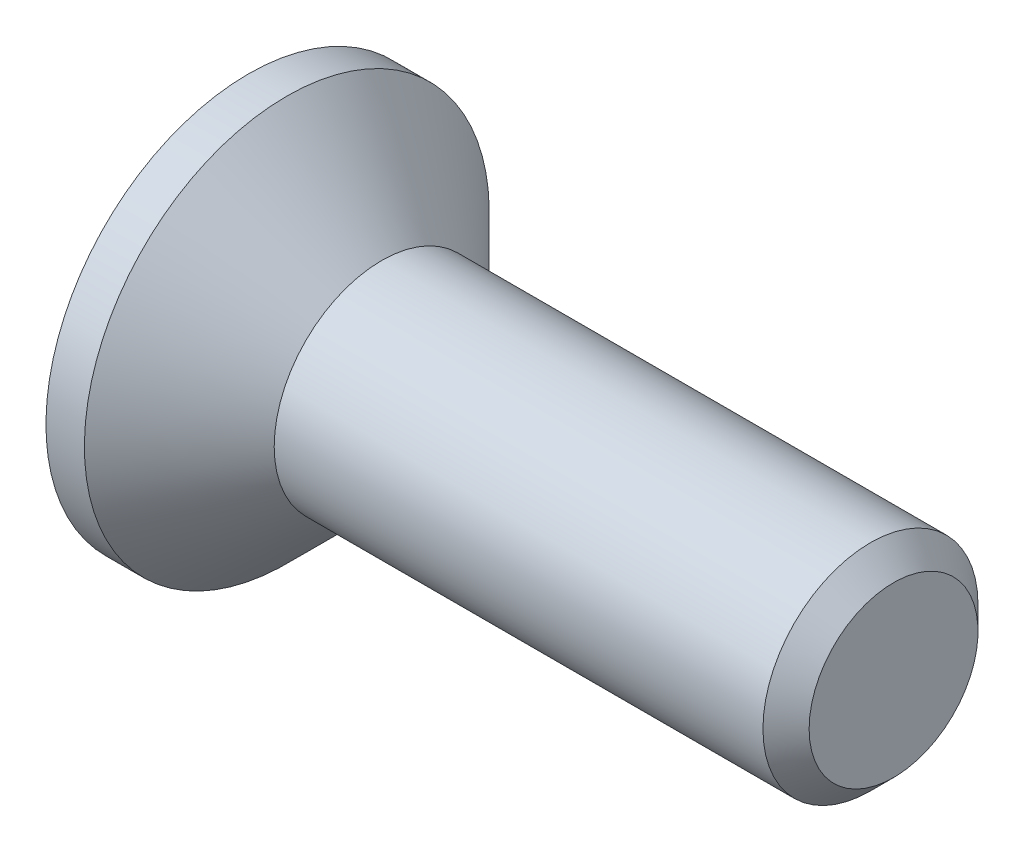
ISO-10303-21;
HEADER;
FILE_DESCRIPTION(('STEP AP214'),'2;1');
FILE_NAME('part.step','',(''),(''),'','','');
FILE_SCHEMA(('AUTOMOTIVE_DESIGN { 1 0 10303 214 1 1 1 1 }'));
ENDSEC;
DATA;
#1=APPLICATION_CONTEXT('core data for automotive mechanical design processes');
#2=APPLICATION_PROTOCOL_DEFINITION('international standard','automotive_design',2000,#1);
#3=PRODUCT_CONTEXT('',#1,'mechanical');
#4=PRODUCT('Part','Part','',(#3));
#5=PRODUCT_RELATED_PRODUCT_CATEGORY('part','',(#4));
#6=PRODUCT_DEFINITION_FORMATION('','',#4);
#7=PRODUCT_DEFINITION_CONTEXT('part definition',#1,'design');
#8=PRODUCT_DEFINITION('design','',#6,#7);
#9=PRODUCT_DEFINITION_SHAPE('','',#8);
#10=(LENGTH_UNIT() NAMED_UNIT(*) SI_UNIT(.MILLI.,.METRE.));
#11=(NAMED_UNIT(*) PLANE_ANGLE_UNIT() SI_UNIT($,.RADIAN.));
#12=(NAMED_UNIT(*) SI_UNIT($,.STERADIAN.) SOLID_ANGLE_UNIT());
#13=UNCERTAINTY_MEASURE_WITH_UNIT(LENGTH_MEASURE(1.E-05),#10,'distance_accuracy_value','');
#14=(GEOMETRIC_REPRESENTATION_CONTEXT(3) GLOBAL_UNCERTAINTY_ASSIGNED_CONTEXT((#13)) GLOBAL_UNIT_ASSIGNED_CONTEXT((#10,
#11,#12)) REPRESENTATION_CONTEXT('',''));
#15=CARTESIAN_POINT('',(0.,0.,0.));
#16=DIRECTION('',(0.,0.,1.));
#17=DIRECTION('',(1.,0.,0.));
#18=AXIS2_PLACEMENT_3D('',#15,#16,#17);
#19=CARTESIAN_POINT('',(0.,-1.25,0.721687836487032));
#20=DIRECTION('',(0.,-0.5,0.866025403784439));
#21=DIRECTION('',(0.,-0.866025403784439,-0.5));
#22=AXIS2_PLACEMENT_3D('',#19,#20,#21);
#23=PLANE('',#22);
#24=DIRECTION('',(1.,0.,0.));
#25=VECTOR('',#24,1.);
#26=CARTESIAN_POINT('',(0.,-1.25,0.721687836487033));
#27=LINE('',#26,#25);
#28=CARTESIAN_POINT('',(1.77999999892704,-1.24999999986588,0.721687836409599));
#29=VERTEX_POINT('',#28);
#30=CARTESIAN_POINT('',(0.,-1.25,0.721687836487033));
#31=VERTEX_POINT('',#30);
#32=EDGE_CURVE('E78',#29,#31,#27,.F.);
#33=ORIENTED_EDGE('',*,*,#32,.T.);
#34=DIRECTION('',(0.,-0.866025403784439,-0.5));
#35=VECTOR('',#34,1.);
#36=CARTESIAN_POINT('',(0.,-1.25,0.721687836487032));
#37=LINE('',#36,#35);
#38=CARTESIAN_POINT('',(0.,0.,1.44337567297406));
#39=VERTEX_POINT('',#38);
#40=EDGE_CURVE('E84',#39,#31,#37,.T.);
#41=ORIENTED_EDGE('',*,*,#40,.F.);
#42=DIRECTION('',(1.,0.,0.));
#43=VECTOR('',#42,1.);
#44=CARTESIAN_POINT('',(0.,0.,1.44337567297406));
#45=LINE('',#44,#43);
#46=CARTESIAN_POINT('',(1.77999999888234,-1.34119913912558E-10,1.44337567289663));
#47=VERTEX_POINT('',#46);
#48=EDGE_CURVE('E81',#39,#47,#45,.T.);
#49=ORIENTED_EDGE('',*,*,#48,.T.);
#50=CARTESIAN_POINT('',(1.77999999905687,-1.24999999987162,0.721687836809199));
#51=CARTESIAN_POINT('',(1.79831528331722,-1.1950700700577,0.753401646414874));
#52=CARTESIAN_POINT('',(1.81497207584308,-1.13966598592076,0.785389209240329));
#53=CARTESIAN_POINT('',(1.84404600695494,-1.02789853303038,0.849918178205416));
#54=CARTESIAN_POINT('',(1.85645286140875,-0.971533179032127,0.882460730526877));
#55=CARTESIAN_POINT('',(1.87576502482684,-0.859500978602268,0.947142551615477));
#56=CARTESIAN_POINT('',(1.8827988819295,-0.803851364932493,0.979271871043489));
#57=CARTESIAN_POINT('',(1.89119426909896,-0.692290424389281,1.04368161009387));
#58=CARTESIAN_POINT('',(1.89256275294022,-0.636379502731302,1.07596179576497));
#59=CARTESIAN_POINT('',(1.88970856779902,-0.531915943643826,1.13627385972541));
#60=CARTESIAN_POINT('',(1.88618669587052,-0.483347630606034,1.1643147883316));
#61=CARTESIAN_POINT('',(1.87502668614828,-0.386527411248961,1.22021396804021));
#62=CARTESIAN_POINT('',(1.8673847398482,-0.338275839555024,1.2480720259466));
#63=CARTESIAN_POINT('',(1.84828135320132,-0.241256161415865,1.30408636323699));
#64=CARTESIAN_POINT('',(1.83673897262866,-0.19250032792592,1.33223555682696));
#65=CARTESIAN_POINT('',(1.81054264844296,-0.0957156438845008,1.38811422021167));
#66=CARTESIAN_POINT('',(1.79589485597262,-0.0476855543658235,1.41584440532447));
#67=CARTESIAN_POINT('',(1.77999999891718,-2.38650799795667E-10,1.44337567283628));
#68=B_SPLINE_CURVE_WITH_KNOTS('',3,(#50,#51,#52,#53,#54,#55,#56,#57,#58,#59,#60,#61,#62,#63,#64,
#65,#66,#67),.UNSPECIFIED.,.F.,.F.,(4,2,2,2,2,2,2,2,4),(0.,0.198135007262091,0.396746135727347,
0.590442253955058,0.783900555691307,0.952317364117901,1.12089012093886,1.29320101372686,
1.46517373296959),.UNSPECIFIED.);
#69=EDGE_CURVE('E21',#29,#47,#68,.T.);
#70=ORIENTED_EDGE('',*,*,#69,.F.);
#71=EDGE_LOOP('',(#33,#41,#49,#70));
#72=FACE_BOUND('',#71,.T.);
#73=ADVANCED_FACE('F17',(#72),#23,.F.);
#74=CARTESIAN_POINT('',(0.,-1.25,-0.721687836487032));
#75=DIRECTION('',(0.,-1.,0.));
#76=DIRECTION('',(0.,0.,-1.));
#77=AXIS2_PLACEMENT_3D('',#74,#75,#76);
#78=PLANE('',#77);
#79=DIRECTION('',(1.,0.,0.));
#80=VECTOR('',#79,1.);
#81=CARTESIAN_POINT('',(0.,-1.25,-0.721687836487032));
#82=LINE('',#81,#80);
#83=CARTESIAN_POINT('',(1.77999999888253,-1.25,-0.721687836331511));
#84=VERTEX_POINT('',#83);
#85=CARTESIAN_POINT('',(0.,-1.25,-0.721687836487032));
#86=VERTEX_POINT('',#85);
#87=EDGE_CURVE('E156',#84,#86,#82,.F.);
#88=ORIENTED_EDGE('',*,*,#87,.T.);
#89=DIRECTION('',(0.,0.,-1.));
#90=VECTOR('',#89,1.);
#91=CARTESIAN_POINT('',(0.,-1.25,-0.721687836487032));
#92=LINE('',#91,#90);
#93=EDGE_CURVE('E94',#31,#86,#92,.T.);
#94=ORIENTED_EDGE('',*,*,#93,.F.);
#95=ORIENTED_EDGE('',*,*,#32,.F.);
#96=CARTESIAN_POINT('',(1.77999999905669,-1.2500000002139,-0.721687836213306));
#97=CARTESIAN_POINT('',(1.79831528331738,-1.25000000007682,-0.658260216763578));
#98=CARTESIAN_POINT('',(1.81497207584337,-1.25000000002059,-0.594285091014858));
#99=CARTESIAN_POINT('',(1.84404600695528,-1.24999999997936,-0.46522715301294));
#100=CARTESIAN_POINT('',(1.85645286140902,-1.24999999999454,-0.400142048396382));
#101=CARTESIAN_POINT('',(1.87576502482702,-1.25000000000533,-0.270778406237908));
#102=CARTESIAN_POINT('',(1.88279888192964,-1.25000000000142,-0.206519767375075));
#103=CARTESIAN_POINT('',(1.89119426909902,-1.24999999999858,-0.077700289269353));
#104=CARTESIAN_POINT('',(1.89256275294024,-1.24999999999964,-0.0131399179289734));
#105=CARTESIAN_POINT('',(1.88970856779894,-1.25000000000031,0.107484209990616));
#106=CARTESIAN_POINT('',(1.88618669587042,-1.25000000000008,0.163566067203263));
#107=CARTESIAN_POINT('',(1.87502668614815,-1.24999999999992,0.27536442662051));
#108=CARTESIAN_POINT('',(1.86738473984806,-1.24999999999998,0.331080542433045));
#109=CARTESIAN_POINT('',(1.84828135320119,-1.25000000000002,0.443109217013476));
#110=CARTESIAN_POINT('',(1.83673897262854,-1.25000000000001,0.499407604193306));
#111=CARTESIAN_POINT('',(1.81054264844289,-1.24999999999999,0.611164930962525));
#112=CARTESIAN_POINT('',(1.79589485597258,-1.24999999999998,0.666625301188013));
#113=CARTESIAN_POINT('',(1.77999999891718,-1.25,0.721687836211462));
#114=B_SPLINE_CURVE_WITH_KNOTS('',3,(#96,#97,#98,#99,#100,#101,#102,#103,#104,#105,#106,#107,
#108,#109,#110,#111,#112,#113),.UNSPECIFIED.,.F.,.F.,(4,2,2,2,2,2,2,2,4),(0.,0.198135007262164,
0.396746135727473,0.590442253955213,0.7839005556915,0.952317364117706,1.12089012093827,
1.29320101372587,1.46517373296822),.UNSPECIFIED.);
#115=EDGE_CURVE('E86',#84,#29,#114,.T.);
#116=ORIENTED_EDGE('',*,*,#115,.F.);
#117=EDGE_LOOP('',(#88,#94,#95,#116));
#118=FACE_BOUND('',#117,.T.);
#119=ADVANCED_FACE('F95',(#118),#78,.F.);
#120=CARTESIAN_POINT('',(0.,0.,1.44337567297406));
#121=DIRECTION('',(0.,0.500000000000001,0.866025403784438));
#122=DIRECTION('',(0.,-0.866025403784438,0.500000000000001));
#123=AXIS2_PLACEMENT_3D('',#120,#121,#122);
#124=PLANE('',#123);
#125=ORIENTED_EDGE('',*,*,#48,.F.);
#126=DIRECTION('',(0.,-0.866025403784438,0.500000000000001));
#127=VECTOR('',#126,1.);
#128=CARTESIAN_POINT('',(0.,0.,1.44337567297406));
#129=LINE('',#128,#127);
#130=CARTESIAN_POINT('',(0.,1.25,0.721687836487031));
#131=VERTEX_POINT('',#130);
#132=EDGE_CURVE('E93',#131,#39,#129,.T.);
#133=ORIENTED_EDGE('',*,*,#132,.F.);
#134=DIRECTION('',(1.,0.,0.));
#135=VECTOR('',#134,1.);
#136=CARTESIAN_POINT('',(0.,1.25,0.721687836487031));
#137=LINE('',#136,#135);
#138=CARTESIAN_POINT('',(1.77999999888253,1.24999999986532,0.721687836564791));
#139=VERTEX_POINT('',#138);
#140=EDGE_CURVE('E217',#131,#139,#137,.T.);
#141=ORIENTED_EDGE('',*,*,#140,.T.);
#142=CARTESIAN_POINT('',(1.77999999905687,3.43192062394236E-10,1.44337567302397));
#143=CARTESIAN_POINT('',(1.79831528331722,0.0549299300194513,1.41166186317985));
#144=CARTESIAN_POINT('',(1.81497207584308,0.110334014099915,1.37967430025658));
#145=CARTESIAN_POINT('',(1.84404600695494,0.222101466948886,1.31514533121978));
#146=CARTESIAN_POINT('',(1.85645286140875,0.278466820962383,1.28260277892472));
#147=CARTESIAN_POINT('',(1.87576502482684,0.39049902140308,1.21792095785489));
#148=CARTESIAN_POINT('',(1.8827988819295,0.446148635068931,1.18579163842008));
#149=CARTESIAN_POINT('',(1.89119426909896,0.557709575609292,1.12138189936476));
#150=CARTESIAN_POINT('',(1.89256275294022,0.613620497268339,1.0891017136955));
#151=CARTESIAN_POINT('',(1.88970856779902,0.718084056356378,1.02878964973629));
#152=CARTESIAN_POINT('',(1.88618669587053,0.766652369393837,1.00074872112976));
#153=CARTESIAN_POINT('',(1.87502668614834,0.863472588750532,0.944849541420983));
#154=CARTESIAN_POINT('',(1.86738473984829,0.911724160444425,0.91699148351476));
#155=CARTESIAN_POINT('',(1.84828135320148,1.00874383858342,0.860977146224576));
#156=CARTESIAN_POINT('',(1.83673897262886,1.05749967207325,0.832827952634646));
#157=CARTESIAN_POINT('',(1.81054264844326,1.15428435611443,0.776949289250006));
#158=CARTESIAN_POINT('',(1.79589485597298,1.202314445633,0.749219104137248));
#159=CARTESIAN_POINT('',(1.7799999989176,1.24999999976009,0.721687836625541));
#160=B_SPLINE_CURVE_WITH_KNOTS('',3,(#142,#143,#144,#145,#146,#147,#148,#149,#150,#151,#152,
#153,#154,#155,#156,#157,#158,#159),.UNSPECIFIED.,.F.,.F.,(4,2,2,2,2,2,2,2,4),(0.,
0.198135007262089,0.396746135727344,0.590442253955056,0.783900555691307,0.952317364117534,
1.12089012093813,1.29320101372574,1.46517373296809),.UNSPECIFIED.);
#161=EDGE_CURVE('E151',#47,#139,#160,.T.);
#162=ORIENTED_EDGE('',*,*,#161,.F.);
#163=EDGE_LOOP('',(#125,#133,#141,#162));
#164=FACE_BOUND('',#163,.T.);
#165=ADVANCED_FACE('F157',(#164),#124,.F.);
#166=CARTESIAN_POINT('',(0.,0.,-1.44337567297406));
#167=DIRECTION('',(0.,-0.5,-0.866025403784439));
#168=DIRECTION('',(0.,0.866025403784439,-0.5));
#169=AXIS2_PLACEMENT_3D('',#166,#167,#168);
#170=PLANE('',#169);
#171=DIRECTION('',(1.,0.,0.));
#172=VECTOR('',#171,1.);
#173=CARTESIAN_POINT('',(0.,0.,-1.44337567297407));
#174=LINE('',#173,#172);
#175=CARTESIAN_POINT('',(1.78000000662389,-5.19425470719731E-08,-1.44337565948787));
#176=VERTEX_POINT('',#175);
#177=CARTESIAN_POINT('',(0.,0.,-1.44337567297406));
#178=VERTEX_POINT('',#177);
#179=EDGE_CURVE('E211',#176,#178,#174,.F.);
#180=ORIENTED_EDGE('',*,*,#179,.T.);
#181=DIRECTION('',(0.,0.866025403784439,-0.5));
#182=VECTOR('',#181,1.);
#183=CARTESIAN_POINT('',(0.,0.,-1.44337567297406));
#184=LINE('',#183,#182);
#185=EDGE_CURVE('E40',#86,#178,#184,.T.);
#186=ORIENTED_EDGE('',*,*,#185,.F.);
#187=ORIENTED_EDGE('',*,*,#87,.F.);
#188=CARTESIAN_POINT('',(1.77999999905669,-1.2499999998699,-0.721687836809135));
#189=CARTESIAN_POINT('',(1.79831528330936,-1.1950700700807,-0.753401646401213));
#190=CARTESIAN_POINT('',(1.81497207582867,-1.13966598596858,-0.785389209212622));
#191=CARTESIAN_POINT('',(1.84404600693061,-1.02789853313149,-0.849918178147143));
#192=CARTESIAN_POINT('',(1.85645286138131,-0.97153317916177,-0.882460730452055));
#193=CARTESIAN_POINT('',(1.87576502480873,-0.859500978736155,-0.947142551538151));
#194=CARTESIAN_POINT('',(1.88279888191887,-0.803851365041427,-0.979271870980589));
#195=CARTESIAN_POINT('',(1.89119426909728,-0.692290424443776,-1.04368161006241));
#196=CARTESIAN_POINT('',(1.89256275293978,-0.636379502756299,-1.07596179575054));
#197=CARTESIAN_POINT('',(1.88970856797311,-0.531915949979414,-1.13627385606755));
#198=CARTESIAN_POINT('',(1.886186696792,-0.483347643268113,-1.16431478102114));
#199=CARTESIAN_POINT('',(1.87502668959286,-0.3865274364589,-1.22021395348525));
#200=CARTESIAN_POINT('',(1.86738474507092,-0.338275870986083,-1.24807200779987));
#201=CARTESIAN_POINT('',(1.84828136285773,-0.241256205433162,-1.30408633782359));
#202=CARTESIAN_POINT('',(1.83673898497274,-0.192500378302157,-1.33223552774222));
#203=CARTESIAN_POINT('',(1.81054266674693,-0.0957157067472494,-1.38811418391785));
#204=CARTESIAN_POINT('',(1.79589487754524,-0.0476856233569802,-1.41584436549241));
#205=CARTESIAN_POINT('',(1.78000002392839,-7.52722782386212E-08,-1.44337562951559));
#206=B_SPLINE_CURVE_WITH_KNOTS('',3,(#188,#189,#190,#191,#192,#193,#194,#195,#196,#197,#198,
#199,#200,#201,#202,#203,#204,#205),.UNSPECIFIED.,.F.,.F.,(4,2,2,2,2,2,2,2,4),(0.,
0.198135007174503,0.396746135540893,0.590442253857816,0.783900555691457,0.952317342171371,
1.12089007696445,1.2932009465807,1.46517364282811),.UNSPECIFIED.);
#207=EDGE_CURVE('E89',#84,#176,#206,.T.);
#208=ORIENTED_EDGE('',*,*,#207,.T.);
#209=EDGE_LOOP('',(#180,#186,#187,#208));
#210=FACE_BOUND('',#209,.T.);
#211=ADVANCED_FACE('F160',(#210),#170,.F.);
#212=CARTESIAN_POINT('',(0.,1.25,0.721687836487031));
#213=DIRECTION('',(0.,1.,0.));
#214=DIRECTION('',(0.,0.,1.));
#215=AXIS2_PLACEMENT_3D('',#212,#213,#214);
#216=PLANE('',#215);
#217=ORIENTED_EDGE('',*,*,#140,.F.);
#218=DIRECTION('',(0.,0.,1.));
#219=VECTOR('',#218,1.);
#220=CARTESIAN_POINT('',(0.,1.25,0.721687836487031));
#221=LINE('',#220,#219);
#222=CARTESIAN_POINT('',(0.,1.25,-0.721687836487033));
#223=VERTEX_POINT('',#222);
#224=EDGE_CURVE('E220',#223,#131,#221,.T.);
#225=ORIENTED_EDGE('',*,*,#224,.F.);
#226=DIRECTION('',(1.,0.,0.));
#227=VECTOR('',#226,1.);
#228=CARTESIAN_POINT('',(0.,1.25,-0.721687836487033));
#229=LINE('',#228,#227);
#230=CARTESIAN_POINT('',(1.77999999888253,1.25,-0.721687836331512));
#231=VERTEX_POINT('',#230);
#232=EDGE_CURVE('E123',#223,#231,#229,.T.);
#233=ORIENTED_EDGE('',*,*,#232,.T.);
#234=CARTESIAN_POINT('',(1.77999999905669,1.2500000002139,-0.721687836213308));
#235=CARTESIAN_POINT('',(1.79831528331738,1.25000000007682,-0.65826021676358));
#236=CARTESIAN_POINT('',(1.81497207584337,1.25000000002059,-0.594285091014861));
#237=CARTESIAN_POINT('',(1.84404600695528,1.24999999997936,-0.465227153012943));
#238=CARTESIAN_POINT('',(1.85645286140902,1.24999999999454,-0.400142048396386));
#239=CARTESIAN_POINT('',(1.87576502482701,1.25000000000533,-0.270778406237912));
#240=CARTESIAN_POINT('',(1.88279888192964,1.25000000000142,-0.206519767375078));
#241=CARTESIAN_POINT('',(1.89119426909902,1.24999999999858,-0.0777002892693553));
#242=CARTESIAN_POINT('',(1.89256275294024,1.24999999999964,-0.0131399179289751));
#243=CARTESIAN_POINT('',(1.88970856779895,1.25000000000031,0.107484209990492));
#244=CARTESIAN_POINT('',(1.88618669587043,1.25000000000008,0.163566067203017));
#245=CARTESIAN_POINT('',(1.87502668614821,1.24999999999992,0.275364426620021));
#246=CARTESIAN_POINT('',(1.86738473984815,1.24999999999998,0.331080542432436));
#247=CARTESIAN_POINT('',(1.84828135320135,1.25000000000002,0.443109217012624));
#248=CARTESIAN_POINT('',(1.83673897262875,1.25000000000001,0.49940760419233));
#249=CARTESIAN_POINT('',(1.8105426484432,1.24999999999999,0.611164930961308));
#250=CARTESIAN_POINT('',(1.79589485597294,1.24999999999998,0.666625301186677));
#251=CARTESIAN_POINT('',(1.7799999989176,1.25,0.72168783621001));
#252=B_SPLINE_CURVE_WITH_KNOTS('',3,(#234,#235,#236,#237,#238,#239,#240,#241,#242,#243,#244,
#245,#246,#247,#248,#249,#250,#251),.UNSPECIFIED.,.F.,.F.,(4,2,2,2,2,2,2,2,4),(0.,
0.198135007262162,0.39674613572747,0.590442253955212,0.783900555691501,0.952317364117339,
1.12089012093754,1.29320101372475,1.46517373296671),.UNSPECIFIED.);
#253=EDGE_CURVE('E124',#231,#139,#252,.T.);
#254=ORIENTED_EDGE('',*,*,#253,.T.);
#255=EDGE_LOOP('',(#217,#225,#233,#254));
#256=FACE_BOUND('',#255,.T.);
#257=ADVANCED_FACE('F135',(#256),#216,.F.);
#258=CARTESIAN_POINT('',(1.77499999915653,0.,0.));
#259=DIRECTION('',(-1.,0.,0.));
#260=DIRECTION('',(0.,0.,1.));
#261=AXIS2_PLACEMENT_3D('',#258,#259,#260);
#262=CONICAL_SURFACE('',#261,1.45203592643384,1.04719754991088);
#263=CARTESIAN_POINT('',(2.61333333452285,-5.6843418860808E-11,0.));
#264=VERTEX_POINT('',#263);
#265=VERTEX_LOOP('',#264);
#266=FACE_BOUND('',#265,.T.);
#267=CARTESIAN_POINT('',(1.77999999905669,1.24999999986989,-0.721687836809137));
#268=CARTESIAN_POINT('',(1.79831528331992,1.19507007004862,-0.753401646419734));
#269=CARTESIAN_POINT('',(1.81497207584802,1.13966598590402,-0.785389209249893));
#270=CARTESIAN_POINT('',(1.84404600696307,1.02789853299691,-0.849918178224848));
#271=CARTESIAN_POINT('',(1.85645286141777,0.97153317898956,-0.88246073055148));
#272=CARTESIAN_POINT('',(1.87576502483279,0.859500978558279,-0.947142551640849));
#273=CARTESIAN_POINT('',(1.88279888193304,0.803851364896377,-0.979271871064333));
#274=CARTESIAN_POINT('',(1.89119426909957,0.692290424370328,-1.04368161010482));
#275=CARTESIAN_POINT('',(1.89256275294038,0.63637950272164,-1.07596179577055));
#276=CARTESIAN_POINT('',(1.88970856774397,0.531915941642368,-1.13627386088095));
#277=CARTESIAN_POINT('',(1.88618669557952,0.483347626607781,-1.16431479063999));
#278=CARTESIAN_POINT('',(1.87502668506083,0.386527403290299,-1.22021397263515));
#279=CARTESIAN_POINT('',(1.86738473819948,0.338275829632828,-1.24807203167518));
#280=CARTESIAN_POINT('',(1.84828135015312,0.241256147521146,-1.30408637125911));
#281=CARTESIAN_POINT('',(1.83673896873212,0.192500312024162,-1.33223556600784));
#282=CARTESIAN_POINT('',(1.81054264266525,0.0957156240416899,-1.38811423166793));
#283=CARTESIAN_POINT('',(1.7958948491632,0.047685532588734,-1.41584441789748));
#284=CARTESIAN_POINT('',(1.77999999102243,-2.34455934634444E-08,-1.44337568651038));
#285=B_SPLINE_CURVE_WITH_KNOTS('',3,(#267,#268,#269,#270,#271,#272,#273,#274,#275,#276,#277,
#278,#279,#280,#281,#282,#283,#284),.UNSPECIFIED.,.F.,.F.,(4,2,2,2,2,2,2,2,4),(0.,
0.198135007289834,0.396746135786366,0.590442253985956,0.783900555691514,0.952317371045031,
1.12089013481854,1.29320103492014,1.4651737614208),.UNSPECIFIED.);
#286=EDGE_CURVE('E117',#231,#176,#285,.T.);
#287=ORIENTED_EDGE('',*,*,#286,.T.);
#288=ORIENTED_EDGE('',*,*,#207,.F.);
#289=ORIENTED_EDGE('',*,*,#115,.T.);
#290=ORIENTED_EDGE('',*,*,#69,.T.);
#291=ORIENTED_EDGE('',*,*,#161,.T.);
#292=ORIENTED_EDGE('',*,*,#253,.F.);
#293=EDGE_LOOP('',(#287,#288,#289,#290,#291,#292));
#294=FACE_BOUND('',#293,.T.);
#295=ADVANCED_FACE('F88',(#266,#294),#262,.F.);
#296=CARTESIAN_POINT('',(0.,1.25,-0.721687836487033));
#297=DIRECTION('',(0.,0.5,-0.866025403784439));
#298=DIRECTION('',(0.,0.866025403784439,0.5));
#299=AXIS2_PLACEMENT_3D('',#296,#297,#298);
#300=PLANE('',#299);
#301=ORIENTED_EDGE('',*,*,#232,.F.);
#302=DIRECTION('',(0.,0.866025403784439,0.5));
#303=VECTOR('',#302,1.);
#304=CARTESIAN_POINT('',(0.,0.,-1.44337567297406));
#305=LINE('',#304,#303);
#306=EDGE_CURVE('E116',#178,#223,#305,.T.);
#307=ORIENTED_EDGE('',*,*,#306,.F.);
#308=ORIENTED_EDGE('',*,*,#179,.F.);
#309=ORIENTED_EDGE('',*,*,#286,.F.);
#310=EDGE_LOOP('',(#301,#307,#308,#309));
#311=FACE_BOUND('',#310,.T.);
#312=ADVANCED_FACE('F130',(#311),#300,.F.);
#313=CARTESIAN_POINT('',(0.,2.60418783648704,0.));
#314=DIRECTION('',(-1.,0.,0.));
#315=DIRECTION('',(0.,0.,1.));
#316=AXIS2_PLACEMENT_3D('',#313,#314,#315);
#317=PLANE('',#316);
#318=ORIENTED_EDGE('',*,*,#185,.T.);
#319=ORIENTED_EDGE('',*,*,#306,.T.);
#320=ORIENTED_EDGE('',*,*,#224,.T.);
#321=ORIENTED_EDGE('',*,*,#132,.T.);
#322=ORIENTED_EDGE('',*,*,#40,.T.);
#323=ORIENTED_EDGE('',*,*,#93,.T.);
#324=EDGE_LOOP('',(#318,#319,#320,#321,#322,#323));
#325=FACE_BOUND('',#324,.T.);
#326=CARTESIAN_POINT('',(0.,0.,0.));
#327=DIRECTION('',(1.,0.,0.));
#328=DIRECTION('',(0.,1.,0.));
#329=AXIS2_PLACEMENT_3D('',#326,#327,#328);
#330=CIRCLE('',#329,3.76500000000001);
#331=CARTESIAN_POINT('',(0.,3.76500000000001,0.));
#332=VERTEX_POINT('',#331);
#333=EDGE_CURVE('E113',#332,#332,#330,.T.);
#334=ORIENTED_EDGE('',*,*,#333,.F.);
#335=EDGE_LOOP('',(#334));
#336=FACE_BOUND('',#335,.T.);
#337=ADVANCED_FACE('F191',(#325,#336),#317,.T.);
#338=CARTESIAN_POINT('',(0.357499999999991,0.,0.));
#339=DIRECTION('',(1.,0.,0.));
#340=DIRECTION('',(0.,1.,0.));
#341=AXIS2_PLACEMENT_3D('',#338,#339,#340);
#342=CYLINDRICAL_SURFACE('',#341,3.76500000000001);
#343=ORIENTED_EDGE('',*,*,#333,.T.);
#344=EDGE_LOOP('',(#343));
#345=FACE_BOUND('',#344,.T.);
#346=CARTESIAN_POINT('',(0.71499999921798,0.,0.));
#347=DIRECTION('',(-1.,0.,0.));
#348=DIRECTION('',(0.,1.,0.));
#349=AXIS2_PLACEMENT_3D('',#346,#347,#348);
#350=CIRCLE('',#349,3.76499999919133);
#351=CARTESIAN_POINT('',(0.71499999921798,3.76499999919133,0.));
#352=VERTEX_POINT('',#351);
#353=EDGE_CURVE('E112',#352,#352,#350,.F.);
#354=ORIENTED_EDGE('',*,*,#353,.F.);
#355=EDGE_LOOP('',(#354));
#356=FACE_BOUND('',#355,.T.);
#357=ADVANCED_FACE('F188',(#345,#356),#342,.T.);
#358=CARTESIAN_POINT('',(12.,0.999999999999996,0.));
#359=DIRECTION('',(1.,0.,0.));
#360=DIRECTION('',(0.,0.,-1.));
#361=AXIS2_PLACEMENT_3D('',#358,#359,#360);
#362=PLANE('',#361);
#363=CARTESIAN_POINT('',(12.000000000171,0.,0.));
#364=DIRECTION('',(-1.,0.,0.));
#365=DIRECTION('',(0.,0.,1.));
#366=AXIS2_PLACEMENT_3D('',#363,#364,#365);
#367=CIRCLE('',#366,1.57058500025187);
#368=CARTESIAN_POINT('',(12.000000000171,0.,1.57058500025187));
#369=VERTEX_POINT('',#368);
#370=EDGE_CURVE('E109',#369,#369,#367,.T.);
#371=ORIENTED_EDGE('',*,*,#370,.F.);
#372=EDGE_LOOP('',(#371));
#373=FACE_BOUND('',#372,.T.);
#374=ADVANCED_FACE('F184',(#373),#362,.T.);
#375=CARTESIAN_POINT('',(0.714999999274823,0.,0.));
#376=DIRECTION('',(-1.,0.,0.));
#377=DIRECTION('',(0.,0.,1.));
#378=AXIS2_PLACEMENT_3D('',#375,#376,#377);
#379=CONICAL_SURFACE('',#378,3.76499999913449,0.785398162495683);
#380=ORIENTED_EDGE('',*,*,#353,.T.);
#381=EDGE_LOOP('',(#380));
#382=FACE_BOUND('',#381,.T.);
#383=CARTESIAN_POINT('',(2.47999999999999,0.,0.));
#384=DIRECTION('',(1.,0.,0.));
#385=DIRECTION('',(0.,1.,0.));
#386=AXIS2_PLACEMENT_3D('',#383,#384,#385);
#387=CIRCLE('',#386,1.99999999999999);
#388=CARTESIAN_POINT('',(2.47999999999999,1.99999999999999,0.));
#389=VERTEX_POINT('',#388);
#390=EDGE_CURVE('E31',#389,#389,#387,.T.);
#391=ORIENTED_EDGE('',*,*,#390,.F.);
#392=EDGE_LOOP('',(#391));
#393=FACE_BOUND('',#392,.T.);
#394=ADVANCED_FACE('F177',(#382,#393),#379,.T.);
#395=CARTESIAN_POINT('',(11.5705849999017,0.,0.));
#396=DIRECTION('',(-1.,0.,0.));
#397=DIRECTION('',(0.,0.,1.));
#398=AXIS2_PLACEMENT_3D('',#395,#396,#397);
#399=CONICAL_SURFACE('',#398,1.99999999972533,0.78539816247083);
#400=ORIENTED_EDGE('',*,*,#370,.T.);
#401=EDGE_LOOP('',(#400));
#402=FACE_BOUND('',#401,.T.);
#403=CARTESIAN_POINT('',(11.570585,0.,0.));
#404=DIRECTION('',(1.,0.,0.));
#405=DIRECTION('',(0.,1.,0.));
#406=AXIS2_PLACEMENT_3D('',#403,#404,#405);
#407=CIRCLE('',#406,1.99999999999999);
#408=CARTESIAN_POINT('',(11.570585,1.99999999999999,0.));
#409=VERTEX_POINT('',#408);
#410=EDGE_CURVE('E11',#409,#409,#407,.F.);
#411=ORIENTED_EDGE('',*,*,#410,.F.);
#412=EDGE_LOOP('',(#411));
#413=FACE_BOUND('',#412,.T.);
#414=ADVANCED_FACE('F171',(#402,#413),#399,.T.);
#415=CARTESIAN_POINT('',(8.5,0.,0.));
#416=DIRECTION('',(1.,0.,0.));
#417=DIRECTION('',(0.,1.,0.));
#418=AXIS2_PLACEMENT_3D('',#415,#416,#417);
#419=CYLINDRICAL_SURFACE('',#418,1.99999999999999);
#420=ORIENTED_EDGE('',*,*,#410,.T.);
#421=EDGE_LOOP('',(#420));
#422=FACE_BOUND('',#421,.T.);
#423=ORIENTED_EDGE('',*,*,#390,.T.);
#424=EDGE_LOOP('',(#423));
#425=FACE_BOUND('',#424,.T.);
#426=ADVANCED_FACE('F169',(#422,#425),#419,.T.);
#427=CLOSED_SHELL('',(#73,#119,#165,#211,#257,#295,#312,#337,#357,#374,#394,#414,#426));
#428=MANIFOLD_SOLID_BREP('B1',#427);
#429=ADVANCED_BREP_SHAPE_REPRESENTATION('',(#18,#428),#14);
#430=SHAPE_DEFINITION_REPRESENTATION(#9,#429);
ENDSEC;
END-ISO-10303-21;
